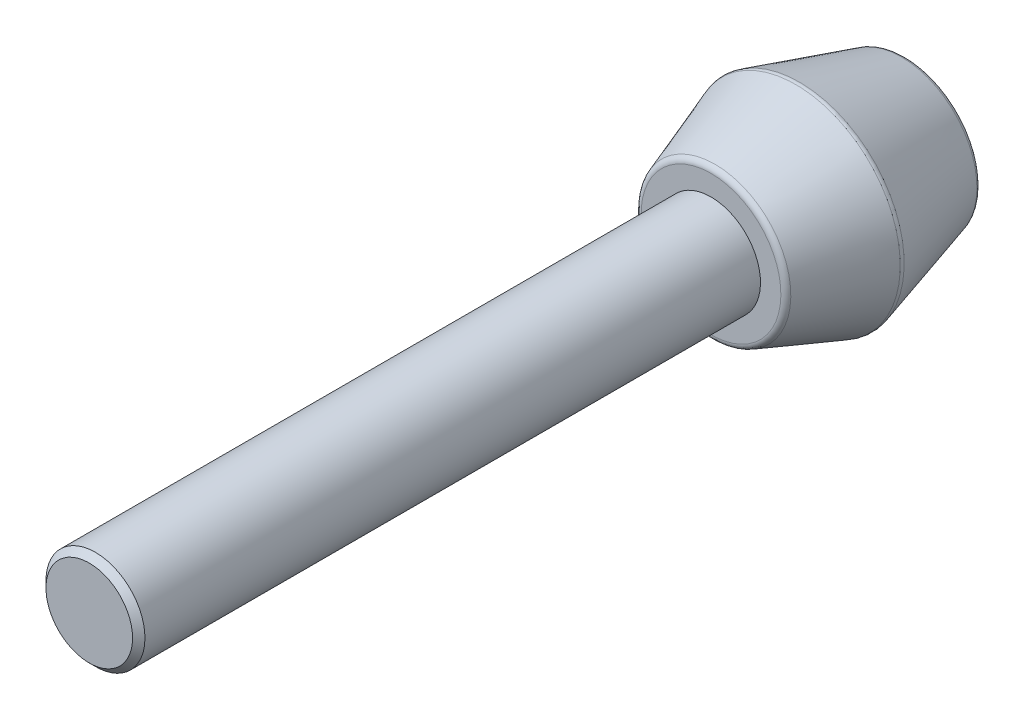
ISO-10303-21;
HEADER;
FILE_DESCRIPTION(('STEP AP214'),'2;1');
FILE_NAME('part.step','',(''),(''),'','','');
FILE_SCHEMA(('AUTOMOTIVE_DESIGN { 1 0 10303 214 1 1 1 1 }'));
ENDSEC;
DATA;
#1=APPLICATION_CONTEXT('core data for automotive mechanical design processes');
#2=APPLICATION_PROTOCOL_DEFINITION('international standard','automotive_design',2000,#1);
#3=PRODUCT_CONTEXT('',#1,'mechanical');
#4=PRODUCT('Part','Part','',(#3));
#5=PRODUCT_RELATED_PRODUCT_CATEGORY('part','',(#4));
#6=PRODUCT_DEFINITION_FORMATION('','',#4);
#7=PRODUCT_DEFINITION_CONTEXT('part definition',#1,'design');
#8=PRODUCT_DEFINITION('design','',#6,#7);
#9=PRODUCT_DEFINITION_SHAPE('','',#8);
#10=(LENGTH_UNIT() NAMED_UNIT(*) SI_UNIT(.MILLI.,.METRE.));
#11=(NAMED_UNIT(*) PLANE_ANGLE_UNIT() SI_UNIT($,.RADIAN.));
#12=(NAMED_UNIT(*) SI_UNIT($,.STERADIAN.) SOLID_ANGLE_UNIT());
#13=UNCERTAINTY_MEASURE_WITH_UNIT(LENGTH_MEASURE(1.E-05),#10,'distance_accuracy_value','');
#14=(GEOMETRIC_REPRESENTATION_CONTEXT(3) GLOBAL_UNCERTAINTY_ASSIGNED_CONTEXT((#13)) GLOBAL_UNIT_ASSIGNED_CONTEXT((#10,
#11,#12)) REPRESENTATION_CONTEXT('',''));
#15=CARTESIAN_POINT('',(0.,0.,0.));
#16=DIRECTION('',(0.,0.,1.));
#17=DIRECTION('',(1.,0.,0.));
#18=AXIS2_PLACEMENT_3D('',#15,#16,#17);
#19=CARTESIAN_POINT('',(0.,0.,2.75));
#20=DIRECTION('',(0.,0.,1.));
#21=DIRECTION('',(-0.876571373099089,0.481271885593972,0.));
#22=AXIS2_PLACEMENT_3D('',#19,#20,#21);
#23=CYLINDRICAL_SURFACE('',#22,4.);
#24=CARTESIAN_POINT('',(0.,0.,65.5));
#25=DIRECTION('',(0.,0.,-1.));
#26=DIRECTION('',(0.876571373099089,-0.481271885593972,0.));
#27=AXIS2_PLACEMENT_3D('',#24,#25,#26);
#28=CIRCLE('',#27,4.);
#29=CARTESIAN_POINT('',(3.50628549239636,-1.92508754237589,65.5));
#30=VERTEX_POINT('',#29);
#31=EDGE_CURVE('E20',#30,#30,#28,.T.);
#32=ORIENTED_EDGE('',*,*,#31,.T.);
#33=EDGE_LOOP('',(#32));
#34=FACE_BOUND('',#33,.T.);
#35=CARTESIAN_POINT('',(0.,0.,15.75));
#36=DIRECTION('',(0.,0.,-1.));
#37=DIRECTION('',(0.,1.,0.));
#38=AXIS2_PLACEMENT_3D('',#35,#36,#37);
#39=CIRCLE('',#38,4.);
#40=CARTESIAN_POINT('',(0.,4.,15.75));
#41=VERTEX_POINT('',#40);
#42=EDGE_CURVE('E8',#41,#41,#39,.F.);
#43=ORIENTED_EDGE('',*,*,#42,.T.);
#44=EDGE_LOOP('',(#43));
#45=FACE_BOUND('',#44,.T.);
#46=ADVANCED_FACE('F12',(#34,#45),#23,.T.);
#47=CARTESIAN_POINT('',(0.,0.,65.5));
#48=DIRECTION('',(0.,0.,-1.));
#49=DIRECTION('',(0.876571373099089,-0.481271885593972,0.));
#50=AXIS2_PLACEMENT_3D('',#47,#48,#49);
#51=CONICAL_SURFACE('',#50,4.,0.785398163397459);
#52=ORIENTED_EDGE('',*,*,#31,.F.);
#53=EDGE_LOOP('',(#52));
#54=FACE_BOUND('',#53,.T.);
#55=CARTESIAN_POINT('',(0.,0.,66.));
#56=DIRECTION('',(0.,0.,1.));
#57=DIRECTION('',(0.876571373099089,-0.481271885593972,0.));
#58=AXIS2_PLACEMENT_3D('',#55,#56,#57);
#59=CIRCLE('',#58,3.5);
#60=CARTESIAN_POINT('',(3.06799980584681,-1.6844515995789,66.));
#61=VERTEX_POINT('',#60);
#62=EDGE_CURVE('E26',#61,#61,#59,.T.);
#63=ORIENTED_EDGE('',*,*,#62,.F.);
#64=EDGE_LOOP('',(#63));
#65=FACE_BOUND('',#64,.T.);
#66=ADVANCED_FACE('F74',(#54,#65),#51,.T.);
#67=CARTESIAN_POINT('',(0.,0.,66.));
#68=DIRECTION('',(0.,0.,-1.));
#69=DIRECTION('',(0.876571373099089,-0.481271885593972,0.));
#70=AXIS2_PLACEMENT_3D('',#67,#68,#69);
#71=PLANE('',#70);
#72=ORIENTED_EDGE('',*,*,#62,.T.);
#73=EDGE_LOOP('',(#72));
#74=FACE_BOUND('',#73,.T.);
#75=ADVANCED_FACE('F81',(#74),#71,.F.);
#76=CARTESIAN_POINT('',(0.,0.,0.));
#77=DIRECTION('',(0.,0.,-1.));
#78=DIRECTION('',(0.925128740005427,-0.379653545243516,0.));
#79=AXIS2_PLACEMENT_3D('',#76,#77,#78);
#80=PLANE('',#79);
#81=CARTESIAN_POINT('',(0.,0.,0.));
#82=DIRECTION('',(0.,0.,-1.));
#83=DIRECTION('',(0.925128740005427,-0.379653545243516,0.));
#84=AXIS2_PLACEMENT_3D('',#81,#82,#83);
#85=CIRCLE('',#84,5.62284929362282);
#86=CARTESIAN_POINT('',(5.20185948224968,-2.1347346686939,0.));
#87=VERTEX_POINT('',#86);
#88=EDGE_CURVE('E38',#87,#87,#85,.T.);
#89=ORIENTED_EDGE('',*,*,#88,.T.);
#90=EDGE_LOOP('',(#89));
#91=FACE_BOUND('',#90,.T.);
#92=ADVANCED_FACE('F52',(#91),#80,.T.);
#93=CARTESIAN_POINT('',(0.,0.,0.5));
#94=DIRECTION('',(0.,0.,-1.));
#95=DIRECTION('',(0.925128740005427,-0.379653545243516,0.));
#96=AXIS2_PLACEMENT_3D('',#93,#94,#95);
#97=TOROIDAL_SURFACE('',#96,5.62284929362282,0.5);
#98=ORIENTED_EDGE('',*,*,#88,.F.);
#99=EDGE_LOOP('',(#98));
#100=FACE_BOUND('',#99,.T.);
#101=CARTESIAN_POINT('',(0.,0.,0.3626394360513));
#102=DIRECTION('',(0.,0.,1.));
#103=DIRECTION('',(0.925128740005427,-0.379653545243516,0.));
#104=AXIS2_PLACEMENT_3D('',#101,#102,#103);
#105=CIRCLE('',#104,6.10361126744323);
#106=CARTESIAN_POINT('',(5.64662620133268,-2.31725765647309,0.3626394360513));
#107=VERTEX_POINT('',#106);
#108=EDGE_CURVE('E43',#107,#107,#105,.T.);
#109=ORIENTED_EDGE('',*,*,#108,.F.);
#110=EDGE_LOOP('',(#109));
#111=FACE_BOUND('',#110,.T.);
#112=ADVANCED_FACE('F54',(#100,#111),#97,.T.);
#113=CARTESIAN_POINT('',(0.,0.,0.));
#114=DIRECTION('',(0.,0.,1.));
#115=DIRECTION('',(-0.925128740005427,0.379653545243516,0.));
#116=AXIS2_PLACEMENT_3D('',#113,#114,#115);
#117=CONICAL_SURFACE('',#116,6.,0.278299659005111);
#118=CARTESIAN_POINT('',(0.,0.,8.59564782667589));
#119=DIRECTION('',(0.,0.,-1.));
#120=DIRECTION('',(0.925128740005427,-0.379653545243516,0.));
#121=AXIS2_PLACEMENT_3D('',#118,#119,#120);
#122=CIRCLE('',#121,8.45589937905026);
#123=CARTESIAN_POINT('',(7.82279553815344,-3.21031217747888,8.59564782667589));
#124=VERTEX_POINT('',#123);
#125=EDGE_CURVE('E39',#124,#124,#122,.T.);
#126=ORIENTED_EDGE('',*,*,#125,.T.);
#127=EDGE_LOOP('',(#126));
#128=FACE_BOUND('',#127,.T.);
#129=ORIENTED_EDGE('',*,*,#108,.T.);
#130=EDGE_LOOP('',(#129));
#131=FACE_BOUND('',#130,.T.);
#132=ADVANCED_FACE('F57',(#128,#131),#117,.T.);
#133=CARTESIAN_POINT('',(0.,0.,8.73300839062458));
#134=DIRECTION('',(0.,0.,-1.));
#135=DIRECTION('',(0.925128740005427,-0.379653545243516,0.));
#136=AXIS2_PLACEMENT_3D('',#133,#134,#135);
#137=TOROIDAL_SURFACE('',#136,7.97513740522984,0.5);
#138=ORIENTED_EDGE('',*,*,#125,.F.);
#139=EDGE_LOOP('',(#138));
#140=FACE_BOUND('',#139,.T.);
#141=CARTESIAN_POINT('',(0.,0.,8.90117658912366));
#142=DIRECTION('',(0.,0.,1.));
#143=DIRECTION('',(-0.925128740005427,0.379653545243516,0.));
#144=AXIS2_PLACEMENT_3D('',#141,#142,#143);
#145=CIRCLE('',#144,8.44600836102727);
#146=CARTESIAN_POINT('',(-7.81364507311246,3.20655701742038,8.90117658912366));
#147=VERTEX_POINT('',#146);
#148=EDGE_CURVE('E16',#147,#147,#145,.T.);
#149=ORIENTED_EDGE('',*,*,#148,.F.);
#150=EDGE_LOOP('',(#149));
#151=FACE_BOUND('',#150,.T.);
#152=ADVANCED_FACE('F61',(#140,#151),#137,.T.);
#153=CARTESIAN_POINT('',(0.,0.,15.75));
#154=DIRECTION('',(0.,0.,-1.));
#155=DIRECTION('',(0.925128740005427,-0.379653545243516,0.));
#156=AXIS2_PLACEMENT_3D('',#153,#154,#155);
#157=CONICAL_SURFACE('',#156,6.,0.343023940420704);
#158=ORIENTED_EDGE('',*,*,#148,.T.);
#159=EDGE_LOOP('',(#158));
#160=FACE_BOUND('',#159,.T.);
#161=CARTESIAN_POINT('',(0.,0.,15.4181681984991));
#162=DIRECTION('',(0.,0.,-1.));
#163=DIRECTION('',(0.925128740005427,-0.379653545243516,0.));
#164=AXIS2_PLACEMENT_3D('',#161,#162,#163);
#165=CIRCLE('',#164,6.1185113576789);
#166=CARTESIAN_POINT('',(5.66041070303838,-2.32291452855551,15.4181681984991));
#167=VERTEX_POINT('',#166);
#168=EDGE_CURVE('E30',#167,#167,#165,.T.);
#169=ORIENTED_EDGE('',*,*,#168,.T.);
#170=EDGE_LOOP('',(#169));
#171=FACE_BOUND('',#170,.T.);
#172=ADVANCED_FACE('F14',(#160,#171),#157,.T.);
#173=CARTESIAN_POINT('',(0.,0.,15.25));
#174=DIRECTION('',(0.,0.,-1.));
#175=DIRECTION('',(0.925128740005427,-0.379653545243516,0.));
#176=AXIS2_PLACEMENT_3D('',#173,#174,#175);
#177=TOROIDAL_SURFACE('',#176,5.64764040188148,0.5);
#178=ORIENTED_EDGE('',*,*,#168,.F.);
#179=EDGE_LOOP('',(#178));
#180=FACE_BOUND('',#179,.T.);
#181=CARTESIAN_POINT('',(0.,0.,15.75));
#182=DIRECTION('',(0.,0.,1.));
#183=DIRECTION('',(0.925128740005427,-0.379653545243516,0.));
#184=AXIS2_PLACEMENT_3D('',#181,#182,#183);
#185=CIRCLE('',#184,5.64764040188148);
#186=CARTESIAN_POINT('',(5.22479444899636,-2.14414670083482,15.75));
#187=VERTEX_POINT('',#186);
#188=EDGE_CURVE('E34',#187,#187,#185,.T.);
#189=ORIENTED_EDGE('',*,*,#188,.F.);
#190=EDGE_LOOP('',(#189));
#191=FACE_BOUND('',#190,.T.);
#192=ADVANCED_FACE('F86',(#180,#191),#177,.T.);
#193=CARTESIAN_POINT('',(0.,0.,15.75));
#194=DIRECTION('',(0.,0.,-1.));
#195=DIRECTION('',(0.925128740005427,-0.379653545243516,0.));
#196=AXIS2_PLACEMENT_3D('',#193,#194,#195);
#197=PLANE('',#196);
#198=ORIENTED_EDGE('',*,*,#188,.T.);
#199=EDGE_LOOP('',(#198));
#200=FACE_BOUND('',#199,.T.);
#201=ORIENTED_EDGE('',*,*,#42,.F.);
#202=EDGE_LOOP('',(#201));
#203=FACE_BOUND('',#202,.T.);
#204=ADVANCED_FACE('F88',(#200,#203),#197,.F.);
#205=CLOSED_SHELL('',(#46,#66,#75,#92,#112,#132,#152,#172,#192,#204));
#206=MANIFOLD_SOLID_BREP('B1',#205);
#207=ADVANCED_BREP_SHAPE_REPRESENTATION('',(#18,#206),#14);
#208=SHAPE_DEFINITION_REPRESENTATION(#9,#207);
ENDSEC;
END-ISO-10303-21;
